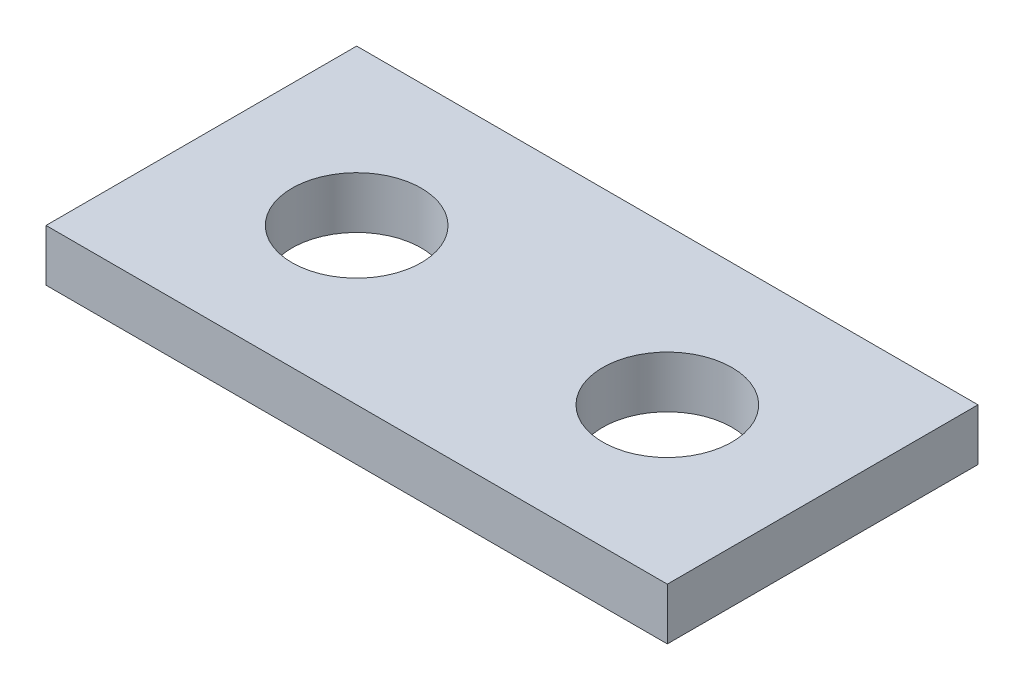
from build123d import *

# Parameters (mm, degrees)
SKETCH1_W           = 19.05
SKETCH1_H           = 9.525
SKETCH1_R           = 1.9812
BOSS_EXTRUDE1_DEPTH = 1.5875


with BuildPart() as part:
    # Sketch1 → Boss-Extrude1 (new body)
    with BuildSketch(Plane(origin=(0, 0, 0), x_dir=(1, 0, 0), z_dir=(0, 1, 0))):
        Rectangle(SKETCH1_W, SKETCH1_H)
        with Locations(Location((-4.7625, 0, 0), (0, 0, 270))):
            Circle(SKETCH1_R, mode=Mode.SUBTRACT)
        with Locations(Location((4.7625, 0, 0), (0, 0, 90))):
            Circle(SKETCH1_R, mode=Mode.SUBTRACT)
    extrude(amount=BOSS_EXTRUDE1_DEPTH)


solid = part.part
